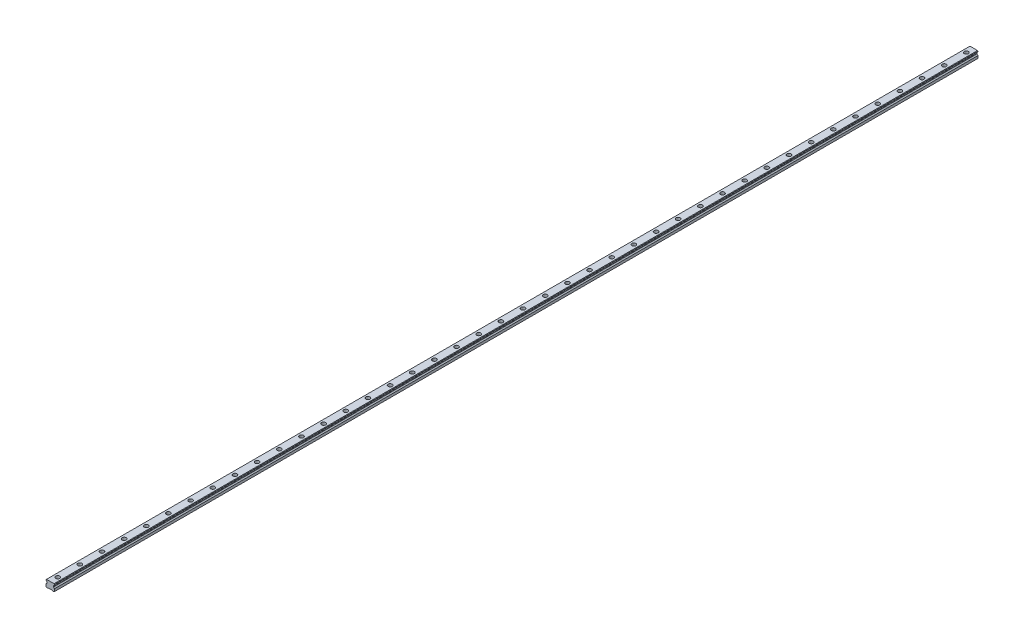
from build123d import *

# Parameters (mm, degrees)
SKETCH1_W           = 23
SKETCH1_H           = 19.2
BOSS_EXTRUDE1_DEPTH = 1250
CUT_EXTRUDE1_DEPTH  = 2501.100175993
CHAMFER1_SIZE       = 1.25
FILLET1_R           = 1.25
CUT_EXTRUDE2_DEPTH  = 2501.100175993
SKETCH4_R           = 5.5
SKETCH4_R_2         = 3.5
CUT_EXTRUDE3_DEPTH  = 9
SKETCH4_2_R         = 3.5
CUT_EXTRUDE4_DEPTH  = 1251.200339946
LPATTERN1_COUNT     = 42
LPATTERN1_PITCH     = 60


with BuildPart() as part:
    # Sketch1 → Boss-Extrude1 (new, symmetric)
    with BuildSketch(Plane.XY):
        with Locations((0, 9.6)):
            Rectangle(SKETCH1_W, SKETCH1_H)
    extrude(amount=BOSS_EXTRUDE1_DEPTH, both=True)

    # Sketch2 → Cut-Extrude1 (cut, through all)
    with BuildSketch(Plane.XY.offset(1250)):
        Polygon((-11.5, 16.7), (-11.5, 7.95), (-8.583333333, 10.866666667), (-8.583333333, 13.783333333), align=None)
        Polygon((8.583333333, 13.783333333), (11.5, 16.7), (11.5, 7.95), (8.583333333, 10.866666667), align=None)
    extrude(amount=-CUT_EXTRUDE1_DEPTH, mode=Mode.SUBTRACT)

    # Chamfer1
    chamfer1_edges = [part.edges().sort_by_distance(p)[0] for p in [
        (-11.5, 19.2, 0),
        (11.5, 19.2, 0),
        (11.5, 0, 0),
        (-11.5, 0, 0),
    ]]
    chamfer(chamfer1_edges, length=CHAMFER1_SIZE)

    # Fillet1
    fillet1_edges = [part.edges().sort_by_distance(p)[0] for p in [
        (-8.583333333, 13.783333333, 0),
        (-8.583333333, 10.866666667, 0),
        (8.583333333, 10.866666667, 0),
        (8.583333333, 13.783333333, 0),
    ]]
    fillet(fillet1_edges, radius=FILLET1_R)

    # Sketch3 → Cut-Extrude2 (cut, through all)
    with BuildSketch(Plane.XY.offset(1250)):
        Polygon((-7, 0), (-5.75, 1.25), (5.75, 1.25), (7, 0), align=None)
    extrude(amount=-CUT_EXTRUDE2_DEPTH, mode=Mode.SUBTRACT)

    # Sketch4 → Cut-Extrude3 (cut)
    with BuildSketch(Plane(origin=(0, 19.2, 0), x_dir=(1, 0, 0), z_dir=(0, 1, 0))):
        with Locations(Location((0, -1230, 0), (0, 0, 270))):
            Circle(SKETCH4_R)
        with Locations(Location((0, -1230, 0), (0, 0, 270))):
            Circle(SKETCH4_R_2, mode=Mode.SUBTRACT)
    cut_extrude3 = extrude(amount=-CUT_EXTRUDE3_DEPTH, mode=Mode.SUBTRACT)

    # Sketch4_2 → Cut-Extrude4 (cut, through all)
    with BuildSketch(Plane(origin=(0, 19.2, 0), x_dir=(1, 0, 0), z_dir=(0, 1, 0))):
        with Locations(Location((0, -1230, 0), (0, 0, 270))):
            Circle(SKETCH4_2_R)
    cut_extrude4 = extrude(amount=-CUT_EXTRUDE4_DEPTH, mode=Mode.SUBTRACT)

    # LPattern1: Cut-Extrude3, Cut-Extrude4 ×42
    with Locations(*[(0, 0, -i * LPATTERN1_PITCH) for i in range(1, LPATTERN1_COUNT)]):
        add(cut_extrude3, mode=Mode.SUBTRACT)
        add(cut_extrude4, mode=Mode.SUBTRACT)


solid = part.part
